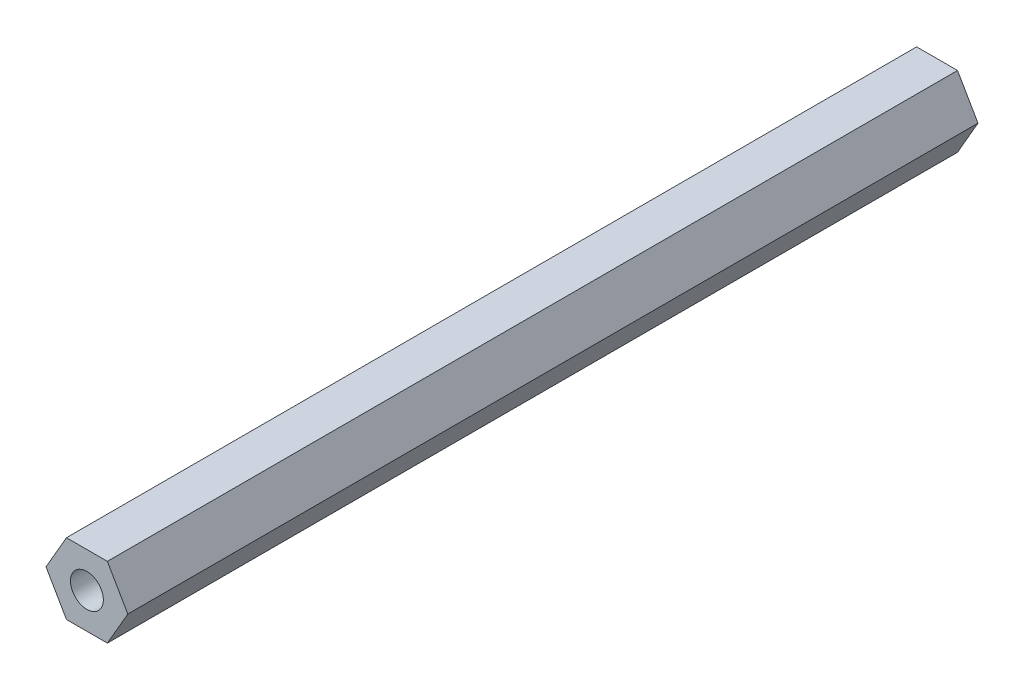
from build123d import *

# Parameters (mm, degrees)
BOSS_EXTRUDE1_DEPTH   = 76.2
F_4_CLEARANCE_HOLE1_D = 2.9464


with BuildPart() as part:
    # Sketch1 → Boss-Extrude1 (new body)
    with BuildSketch(Plane.XY):
        Polygon((1.833087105, 3.175), (-1.833087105, 3.175), (-3.666174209, 0), (-1.833087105, -3.175), (1.833087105, -3.175), (3.666174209, 0), align=None)
    extrude(amount=BOSS_EXTRUDE1_DEPTH)

    # 4 Clearance Hole1 (through all)
    with Locations(Plane.XY.offset(76.2)):
        with Locations((0, 0)):
            Hole(F_4_CLEARANCE_HOLE1_D / 2)


solid = part.part
